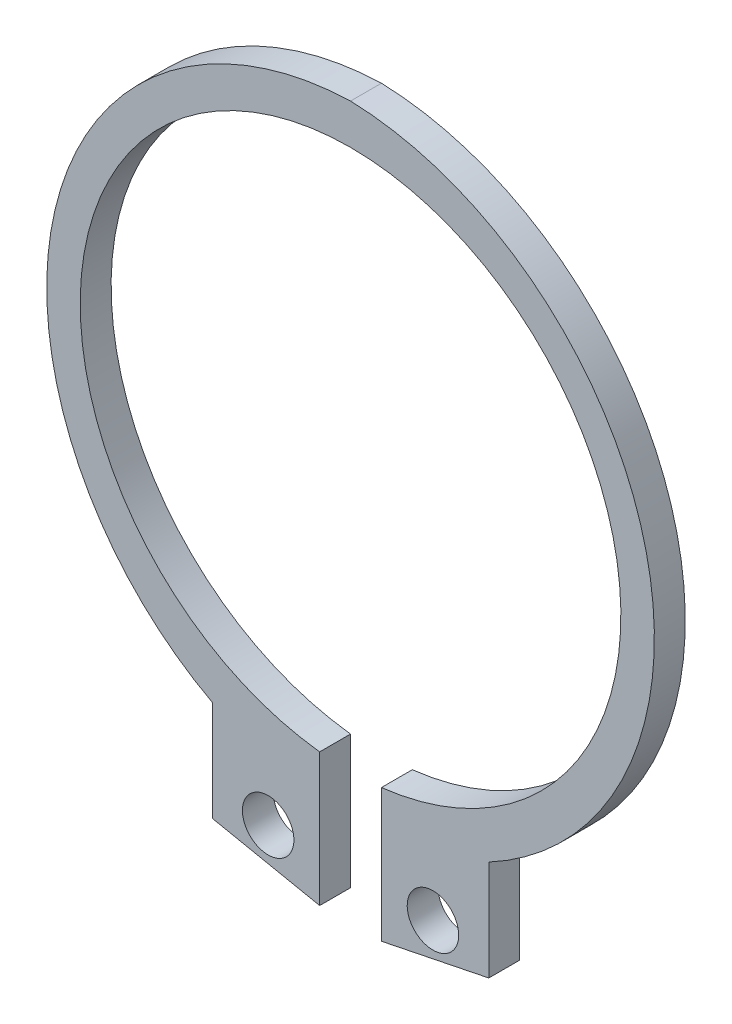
ISO-10303-21;
HEADER;
FILE_DESCRIPTION(('STEP AP214'),'2;1');
FILE_NAME('part.step','',(''),(''),'','','');
FILE_SCHEMA(('AUTOMOTIVE_DESIGN { 1 0 10303 214 1 1 1 1 }'));
ENDSEC;
DATA;
#1=APPLICATION_CONTEXT('core data for automotive mechanical design processes');
#2=APPLICATION_PROTOCOL_DEFINITION('international standard','automotive_design',2000,#1);
#3=PRODUCT_CONTEXT('',#1,'mechanical');
#4=PRODUCT('Part','Part','',(#3));
#5=PRODUCT_RELATED_PRODUCT_CATEGORY('part','',(#4));
#6=PRODUCT_DEFINITION_FORMATION('','',#4);
#7=PRODUCT_DEFINITION_CONTEXT('part definition',#1,'design');
#8=PRODUCT_DEFINITION('design','',#6,#7);
#9=PRODUCT_DEFINITION_SHAPE('','',#8);
#10=(LENGTH_UNIT() NAMED_UNIT(*) SI_UNIT(.MILLI.,.METRE.));
#11=(NAMED_UNIT(*) PLANE_ANGLE_UNIT() SI_UNIT($,.RADIAN.));
#12=(NAMED_UNIT(*) SI_UNIT($,.STERADIAN.) SOLID_ANGLE_UNIT());
#13=UNCERTAINTY_MEASURE_WITH_UNIT(LENGTH_MEASURE(1.E-05),#10,'distance_accuracy_value','');
#14=(GEOMETRIC_REPRESENTATION_CONTEXT(3) GLOBAL_UNCERTAINTY_ASSIGNED_CONTEXT((#13)) GLOBAL_UNIT_ASSIGNED_CONTEXT((#10,
#11,#12)) REPRESENTATION_CONTEXT('',''));
#15=CARTESIAN_POINT('',(0.,0.,0.));
#16=DIRECTION('',(0.,0.,1.));
#17=DIRECTION('',(1.,0.,0.));
#18=AXIS2_PLACEMENT_3D('',#15,#16,#17);
#19=CARTESIAN_POINT('',(-5.369716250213,-14.7531741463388,1.2));
#20=DIRECTION('',(0.199489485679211,0.979899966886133,0.));
#21=DIRECTION('',(-0.979899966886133,0.199489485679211,0.));
#22=AXIS2_PLACEMENT_3D('',#19,#20,#21);
#23=PLANE('',#22);
#24=DIRECTION('',(0.979899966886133,-0.199489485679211,0.));
#25=VECTOR('',#24,1.);
#26=CARTESIAN_POINT('',(-5.369716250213,-14.7531741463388,0.));
#27=LINE('',#26,#25);
#28=CARTESIAN_POINT('',(-5.369716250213,-14.7531741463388,0.));
#29=VERTEX_POINT('',#28);
#30=CARTESIAN_POINT('',(-1.2,-15.6020511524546,0.));
#31=VERTEX_POINT('',#30);
#32=EDGE_CURVE('E112',#29,#31,#27,.T.);
#33=ORIENTED_EDGE('',*,*,#32,.T.);
#34=DIRECTION('',(0.,0.,1.));
#35=VECTOR('',#34,1.);
#36=CARTESIAN_POINT('',(-1.2,-15.6020511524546,1.2));
#37=LINE('',#36,#35);
#38=CARTESIAN_POINT('',(-1.2,-15.6020511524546,1.2));
#39=VERTEX_POINT('',#38);
#40=EDGE_CURVE('E32',#31,#39,#37,.T.);
#41=ORIENTED_EDGE('',*,*,#40,.T.);
#42=DIRECTION('',(0.979899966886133,-0.199489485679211,0.));
#43=VECTOR('',#42,1.);
#44=CARTESIAN_POINT('',(-5.369716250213,-14.7531741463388,1.2));
#45=LINE('',#44,#43);
#46=CARTESIAN_POINT('',(-5.369716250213,-14.7531741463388,1.2));
#47=VERTEX_POINT('',#46);
#48=EDGE_CURVE('E138',#47,#39,#45,.T.);
#49=ORIENTED_EDGE('',*,*,#48,.F.);
#50=DIRECTION('',(0.,0.,-1.));
#51=VECTOR('',#50,1.);
#52=CARTESIAN_POINT('',(-5.369716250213,-14.7531741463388,1.2));
#53=LINE('',#52,#51);
#54=EDGE_CURVE('E131',#47,#29,#53,.T.);
#55=ORIENTED_EDGE('',*,*,#54,.T.);
#56=EDGE_LOOP('',(#33,#41,#49,#55));
#57=FACE_BOUND('',#56,.T.);
#58=ADVANCED_FACE('F17',(#57),#23,.F.);
#59=CARTESIAN_POINT('',(0.,0.,1.2));
#60=DIRECTION('',(0.,0.,-1.));
#61=DIRECTION('',(-1.,0.,0.));
#62=AXIS2_PLACEMENT_3D('',#59,#60,#61);
#63=CYLINDRICAL_SURFACE('',#62,10.5);
#64=DIRECTION('',(0.,0.,-1.));
#65=VECTOR('',#64,1.);
#66=CARTESIAN_POINT('',(-1.2,-10.4312031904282,1.2));
#67=LINE('',#66,#65);
#68=CARTESIAN_POINT('',(-1.2,-10.4312031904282,0.));
#69=VERTEX_POINT('',#68);
#70=CARTESIAN_POINT('',(-1.2,-10.4312031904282,1.2));
#71=VERTEX_POINT('',#70);
#72=EDGE_CURVE('E94',#69,#71,#67,.F.);
#73=ORIENTED_EDGE('',*,*,#72,.F.);
#74=CARTESIAN_POINT('',(0.,0.,0.));
#75=DIRECTION('',(0.,0.,1.));
#76=DIRECTION('',(1.,0.,0.));
#77=AXIS2_PLACEMENT_3D('',#74,#75,#76);
#78=CIRCLE('',#77,10.5);
#79=CARTESIAN_POINT('',(1.2,-10.4312031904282,0.));
#80=VERTEX_POINT('',#79);
#81=EDGE_CURVE('E101',#80,#69,#78,.T.);
#82=ORIENTED_EDGE('',*,*,#81,.F.);
#83=DIRECTION('',(0.,0.,-1.));
#84=VECTOR('',#83,1.);
#85=CARTESIAN_POINT('',(1.2,-10.4312031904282,1.2));
#86=LINE('',#85,#84);
#87=CARTESIAN_POINT('',(1.2,-10.4312031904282,1.2));
#88=VERTEX_POINT('',#87);
#89=EDGE_CURVE('E85',#88,#80,#86,.T.);
#90=ORIENTED_EDGE('',*,*,#89,.F.);
#91=CARTESIAN_POINT('',(0.,0.,1.2));
#92=DIRECTION('',(0.,0.,1.));
#93=DIRECTION('',(1.,0.,0.));
#94=AXIS2_PLACEMENT_3D('',#91,#92,#93);
#95=CIRCLE('',#94,10.5);
#96=EDGE_CURVE('E135',#88,#71,#95,.T.);
#97=ORIENTED_EDGE('',*,*,#96,.T.);
#98=EDGE_LOOP('',(#73,#82,#90,#97));
#99=FACE_BOUND('',#98,.T.);
#100=ADVANCED_FACE('F109',(#99),#63,.F.);
#101=CARTESIAN_POINT('',(0.380306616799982,-0.114910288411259,1.2));
#102=DIRECTION('',(0.,0.,-1.));
#103=DIRECTION('',(-1.,0.,0.));
#104=AXIS2_PLACEMENT_3D('',#101,#102,#103);
#105=CYLINDRICAL_SURFACE('',#104,12.1808486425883);
#106=CARTESIAN_POINT('',(0.380306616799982,-0.114910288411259,0.));
#107=DIRECTION('',(0.,0.,1.));
#108=DIRECTION('',(1.,0.,0.));
#109=AXIS2_PLACEMENT_3D('',#106,#107,#108);
#110=CIRCLE('',#109,12.1808486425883);
#111=CARTESIAN_POINT('',(0.,12.06,0.));
#112=VERTEX_POINT('',#111);
#113=CARTESIAN_POINT('',(-5.369716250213,-10.8531741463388,0.));
#114=VERTEX_POINT('',#113);
#115=EDGE_CURVE('E111',#112,#114,#110,.T.);
#116=ORIENTED_EDGE('',*,*,#115,.T.);
#117=DIRECTION('',(0.,0.,-1.));
#118=VECTOR('',#117,1.);
#119=CARTESIAN_POINT('',(-5.369716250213,-10.8531741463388,1.2));
#120=LINE('',#119,#118);
#121=CARTESIAN_POINT('',(-5.369716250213,-10.8531741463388,1.2));
#122=VERTEX_POINT('',#121);
#123=EDGE_CURVE('E145',#122,#114,#120,.T.);
#124=ORIENTED_EDGE('',*,*,#123,.F.);
#125=CARTESIAN_POINT('',(0.380306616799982,-0.114910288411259,1.2));
#126=DIRECTION('',(0.,0.,1.));
#127=DIRECTION('',(1.,0.,0.));
#128=AXIS2_PLACEMENT_3D('',#125,#126,#127);
#129=CIRCLE('',#128,12.1808486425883);
#130=CARTESIAN_POINT('',(0.,12.06,1.2));
#131=VERTEX_POINT('',#130);
#132=EDGE_CURVE('E132',#131,#122,#129,.T.);
#133=ORIENTED_EDGE('',*,*,#132,.F.);
#134=DIRECTION('',(0.,0.,-1.));
#135=VECTOR('',#134,1.);
#136=CARTESIAN_POINT('',(0.,12.06,1.2));
#137=LINE('',#136,#135);
#138=EDGE_CURVE('E25',#131,#112,#137,.T.);
#139=ORIENTED_EDGE('',*,*,#138,.T.);
#140=EDGE_LOOP('',(#116,#124,#133,#139));
#141=FACE_BOUND('',#140,.T.);
#142=ADVANCED_FACE('F238',(#141),#105,.T.);
#143=CARTESIAN_POINT('',(-5.369716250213,-14.7531741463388,1.2));
#144=DIRECTION('',(-1.,0.,0.));
#145=DIRECTION('',(0.,0.,1.));
#146=AXIS2_PLACEMENT_3D('',#143,#144,#145);
#147=PLANE('',#146);
#148=DIRECTION('',(0.,1.,0.));
#149=VECTOR('',#148,1.);
#150=CARTESIAN_POINT('',(-5.369716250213,-14.7531741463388,0.));
#151=LINE('',#150,#149);
#152=EDGE_CURVE('E119',#29,#114,#151,.T.);
#153=ORIENTED_EDGE('',*,*,#152,.F.);
#154=ORIENTED_EDGE('',*,*,#54,.F.);
#155=DIRECTION('',(0.,1.,0.));
#156=VECTOR('',#155,1.);
#157=CARTESIAN_POINT('',(-5.369716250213,-14.7531741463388,1.2));
#158=LINE('',#157,#156);
#159=EDGE_CURVE('E127',#47,#122,#158,.T.);
#160=ORIENTED_EDGE('',*,*,#159,.T.);
#161=ORIENTED_EDGE('',*,*,#123,.T.);
#162=EDGE_LOOP('',(#153,#154,#160,#161));
#163=FACE_BOUND('',#162,.T.);
#164=ADVANCED_FACE('F158',(#163),#147,.T.);
#165=CARTESIAN_POINT('',(0.,0.,1.2));
#166=DIRECTION('',(0.,0.,1.));
#167=DIRECTION('',(1.,0.,0.));
#168=AXIS2_PLACEMENT_3D('',#165,#166,#167);
#169=PLANE('',#168);
#170=CARTESIAN_POINT('',(3.2,-13.9,1.2));
#171=DIRECTION('',(0.,0.,-1.));
#172=DIRECTION('',(0.,1.,0.));
#173=AXIS2_PLACEMENT_3D('',#170,#171,#172);
#174=CIRCLE('',#173,1.);
#175=CARTESIAN_POINT('',(3.2,-12.9,1.2));
#176=VERTEX_POINT('',#175);
#177=EDGE_CURVE('E208',#176,#176,#174,.T.);
#178=ORIENTED_EDGE('',*,*,#177,.T.);
#179=EDGE_LOOP('',(#178));
#180=FACE_BOUND('',#179,.T.);
#181=CARTESIAN_POINT('',(-3.2,-13.9,1.2));
#182=DIRECTION('',(0.,0.,-1.));
#183=DIRECTION('',(0.,1.,0.));
#184=AXIS2_PLACEMENT_3D('',#181,#182,#183);
#185=CIRCLE('',#184,1.);
#186=CARTESIAN_POINT('',(-3.2,-12.9,1.2));
#187=VERTEX_POINT('',#186);
#188=EDGE_CURVE('E199',#187,#187,#185,.T.);
#189=ORIENTED_EDGE('',*,*,#188,.T.);
#190=EDGE_LOOP('',(#189));
#191=FACE_BOUND('',#190,.T.);
#192=DIRECTION('',(0.,1.,0.));
#193=VECTOR('',#192,1.);
#194=CARTESIAN_POINT('',(-1.2,-9.05,1.2));
#195=LINE('',#194,#193);
#196=EDGE_CURVE('E95',#39,#71,#195,.T.);
#197=ORIENTED_EDGE('',*,*,#196,.T.);
#198=ORIENTED_EDGE('',*,*,#96,.F.);
#199=DIRECTION('',(0.,-1.,0.));
#200=VECTOR('',#199,1.);
#201=CARTESIAN_POINT('',(1.2,-9.05,1.2));
#202=LINE('',#201,#200);
#203=CARTESIAN_POINT('',(1.2,-15.6020511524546,1.2));
#204=VERTEX_POINT('',#203);
#205=EDGE_CURVE('E88',#88,#204,#202,.T.);
#206=ORIENTED_EDGE('',*,*,#205,.T.);
#207=DIRECTION('',(-0.979899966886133,-0.199489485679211,0.));
#208=VECTOR('',#207,1.);
#209=CARTESIAN_POINT('',(5.369716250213,-14.7531741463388,1.2));
#210=LINE('',#209,#208);
#211=CARTESIAN_POINT('',(5.369716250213,-14.7531741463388,1.2));
#212=VERTEX_POINT('',#211);
#213=EDGE_CURVE('E179',#212,#204,#210,.T.);
#214=ORIENTED_EDGE('',*,*,#213,.F.);
#215=DIRECTION('',(0.,1.,0.));
#216=VECTOR('',#215,1.);
#217=CARTESIAN_POINT('',(5.369716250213,-14.7531741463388,1.2));
#218=LINE('',#217,#216);
#219=CARTESIAN_POINT('',(5.369716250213,-10.8531741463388,1.2));
#220=VERTEX_POINT('',#219);
#221=EDGE_CURVE('E173',#212,#220,#218,.T.);
#222=ORIENTED_EDGE('',*,*,#221,.T.);
#223=CARTESIAN_POINT('',(-0.380306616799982,-0.114910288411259,1.2));
#224=DIRECTION('',(0.,0.,-1.));
#225=DIRECTION('',(-1.,0.,0.));
#226=AXIS2_PLACEMENT_3D('',#223,#224,#225);
#227=CIRCLE('',#226,12.1808486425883);
#228=EDGE_CURVE('E183',#131,#220,#227,.T.);
#229=ORIENTED_EDGE('',*,*,#228,.F.);
#230=ORIENTED_EDGE('',*,*,#132,.T.);
#231=ORIENTED_EDGE('',*,*,#159,.F.);
#232=ORIENTED_EDGE('',*,*,#48,.T.);
#233=EDGE_LOOP('',(#197,#198,#206,#214,#222,#229,#230,#231,#232));
#234=FACE_BOUND('',#233,.T.);
#235=ADVANCED_FACE('F247',(#180,#191,#234),#169,.T.);
#236=CARTESIAN_POINT('',(0.,0.,0.));
#237=DIRECTION('',(0.,0.,1.));
#238=DIRECTION('',(1.,0.,0.));
#239=AXIS2_PLACEMENT_3D('',#236,#237,#238);
#240=PLANE('',#239);
#241=CARTESIAN_POINT('',(3.2,-13.9,0.));
#242=DIRECTION('',(0.,0.,1.));
#243=DIRECTION('',(0.,1.,0.));
#244=AXIS2_PLACEMENT_3D('',#241,#242,#243);
#245=CIRCLE('',#244,1.);
#246=CARTESIAN_POINT('',(3.2,-12.9,0.));
#247=VERTEX_POINT('',#246);
#248=EDGE_CURVE('E212',#247,#247,#245,.T.);
#249=ORIENTED_EDGE('',*,*,#248,.T.);
#250=EDGE_LOOP('',(#249));
#251=FACE_BOUND('',#250,.T.);
#252=CARTESIAN_POINT('',(-3.2,-13.9,0.));
#253=DIRECTION('',(0.,0.,1.));
#254=DIRECTION('',(0.,1.,0.));
#255=AXIS2_PLACEMENT_3D('',#252,#253,#254);
#256=CIRCLE('',#255,1.);
#257=CARTESIAN_POINT('',(-3.2,-12.9,0.));
#258=VERTEX_POINT('',#257);
#259=EDGE_CURVE('E204',#258,#258,#256,.T.);
#260=ORIENTED_EDGE('',*,*,#259,.T.);
#261=EDGE_LOOP('',(#260));
#262=FACE_BOUND('',#261,.T.);
#263=ORIENTED_EDGE('',*,*,#81,.T.);
#264=DIRECTION('',(0.,-1.,0.));
#265=VECTOR('',#264,1.);
#266=CARTESIAN_POINT('',(-1.2,-9.05,0.));
#267=LINE('',#266,#265);
#268=EDGE_CURVE('E106',#69,#31,#267,.T.);
#269=ORIENTED_EDGE('',*,*,#268,.T.);
#270=ORIENTED_EDGE('',*,*,#32,.F.);
#271=ORIENTED_EDGE('',*,*,#152,.T.);
#272=ORIENTED_EDGE('',*,*,#115,.F.);
#273=CARTESIAN_POINT('',(-0.380306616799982,-0.114910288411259,0.));
#274=DIRECTION('',(0.,0.,-1.));
#275=DIRECTION('',(-1.,0.,0.));
#276=AXIS2_PLACEMENT_3D('',#273,#274,#275);
#277=CIRCLE('',#276,12.1808486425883);
#278=CARTESIAN_POINT('',(5.369716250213,-10.8531741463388,0.));
#279=VERTEX_POINT('',#278);
#280=EDGE_CURVE('E172',#112,#279,#277,.T.);
#281=ORIENTED_EDGE('',*,*,#280,.T.);
#282=DIRECTION('',(0.,1.,0.));
#283=VECTOR('',#282,1.);
#284=CARTESIAN_POINT('',(5.369716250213,-14.7531741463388,0.));
#285=LINE('',#284,#283);
#286=CARTESIAN_POINT('',(5.369716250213,-14.7531741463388,0.));
#287=VERTEX_POINT('',#286);
#288=EDGE_CURVE('E167',#287,#279,#285,.T.);
#289=ORIENTED_EDGE('',*,*,#288,.F.);
#290=DIRECTION('',(-0.979899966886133,-0.199489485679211,0.));
#291=VECTOR('',#290,1.);
#292=CARTESIAN_POINT('',(5.369716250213,-14.7531741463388,0.));
#293=LINE('',#292,#291);
#294=CARTESIAN_POINT('',(1.2,-15.6020511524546,0.));
#295=VERTEX_POINT('',#294);
#296=EDGE_CURVE('E104',#287,#295,#293,.T.);
#297=ORIENTED_EDGE('',*,*,#296,.T.);
#298=DIRECTION('',(0.,1.,0.));
#299=VECTOR('',#298,1.);
#300=CARTESIAN_POINT('',(1.2,-9.05,0.));
#301=LINE('',#300,#299);
#302=EDGE_CURVE('E40',#295,#80,#301,.T.);
#303=ORIENTED_EDGE('',*,*,#302,.T.);
#304=EDGE_LOOP('',(#263,#269,#270,#271,#272,#281,#289,#297,#303));
#305=FACE_BOUND('',#304,.T.);
#306=ADVANCED_FACE('F100',(#251,#262,#305),#240,.F.);
#307=CARTESIAN_POINT('',(5.369716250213,-14.7531741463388,0.));
#308=DIRECTION('',(-0.199489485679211,0.979899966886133,0.));
#309=DIRECTION('',(0.979899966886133,0.199489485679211,0.));
#310=AXIS2_PLACEMENT_3D('',#307,#308,#309);
#311=PLANE('',#310);
#312=ORIENTED_EDGE('',*,*,#213,.T.);
#313=DIRECTION('',(0.,0.,-1.));
#314=VECTOR('',#313,1.);
#315=CARTESIAN_POINT('',(1.2,-15.6020511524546,0.));
#316=LINE('',#315,#314);
#317=EDGE_CURVE('E11',#204,#295,#316,.T.);
#318=ORIENTED_EDGE('',*,*,#317,.T.);
#319=ORIENTED_EDGE('',*,*,#296,.F.);
#320=DIRECTION('',(0.,0.,1.));
#321=VECTOR('',#320,1.);
#322=CARTESIAN_POINT('',(5.369716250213,-14.7531741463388,0.));
#323=LINE('',#322,#321);
#324=EDGE_CURVE('E164',#287,#212,#323,.T.);
#325=ORIENTED_EDGE('',*,*,#324,.T.);
#326=EDGE_LOOP('',(#312,#318,#319,#325));
#327=FACE_BOUND('',#326,.T.);
#328=ADVANCED_FACE('F253',(#327),#311,.F.);
#329=CARTESIAN_POINT('',(-0.380306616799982,-0.114910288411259,0.));
#330=DIRECTION('',(0.,0.,1.));
#331=DIRECTION('',(1.,0.,0.));
#332=AXIS2_PLACEMENT_3D('',#329,#330,#331);
#333=CYLINDRICAL_SURFACE('',#332,12.1808486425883);
#334=ORIENTED_EDGE('',*,*,#228,.T.);
#335=DIRECTION('',(0.,0.,1.));
#336=VECTOR('',#335,1.);
#337=CARTESIAN_POINT('',(5.369716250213,-10.8531741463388,0.));
#338=LINE('',#337,#336);
#339=EDGE_CURVE('E123',#279,#220,#338,.T.);
#340=ORIENTED_EDGE('',*,*,#339,.F.);
#341=ORIENTED_EDGE('',*,*,#280,.F.);
#342=ORIENTED_EDGE('',*,*,#138,.F.);
#343=EDGE_LOOP('',(#334,#340,#341,#342));
#344=FACE_BOUND('',#343,.T.);
#345=ADVANCED_FACE('F256',(#344),#333,.T.);
#346=CARTESIAN_POINT('',(5.369716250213,-14.7531741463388,0.));
#347=DIRECTION('',(1.,0.,0.));
#348=DIRECTION('',(0.,0.,-1.));
#349=AXIS2_PLACEMENT_3D('',#346,#347,#348);
#350=PLANE('',#349);
#351=ORIENTED_EDGE('',*,*,#221,.F.);
#352=ORIENTED_EDGE('',*,*,#324,.F.);
#353=ORIENTED_EDGE('',*,*,#288,.T.);
#354=ORIENTED_EDGE('',*,*,#339,.T.);
#355=EDGE_LOOP('',(#351,#352,#353,#354));
#356=FACE_BOUND('',#355,.T.);
#357=ADVANCED_FACE('F260',(#356),#350,.T.);
#358=CARTESIAN_POINT('',(1.2,-9.05,0.));
#359=DIRECTION('',(1.,0.,0.));
#360=DIRECTION('',(0.,0.,-1.));
#361=AXIS2_PLACEMENT_3D('',#358,#359,#360);
#362=PLANE('',#361);
#363=ORIENTED_EDGE('',*,*,#89,.T.);
#364=ORIENTED_EDGE('',*,*,#302,.F.);
#365=ORIENTED_EDGE('',*,*,#317,.F.);
#366=ORIENTED_EDGE('',*,*,#205,.F.);
#367=EDGE_LOOP('',(#363,#364,#365,#366));
#368=FACE_BOUND('',#367,.T.);
#369=ADVANCED_FACE('F86',(#368),#362,.F.);
#370=CARTESIAN_POINT('',(-1.2,-9.05,0.));
#371=DIRECTION('',(-1.,0.,0.));
#372=DIRECTION('',(0.,0.,1.));
#373=AXIS2_PLACEMENT_3D('',#370,#371,#372);
#374=PLANE('',#373);
#375=ORIENTED_EDGE('',*,*,#268,.F.);
#376=ORIENTED_EDGE('',*,*,#72,.T.);
#377=ORIENTED_EDGE('',*,*,#196,.F.);
#378=ORIENTED_EDGE('',*,*,#40,.F.);
#379=EDGE_LOOP('',(#375,#376,#377,#378));
#380=FACE_BOUND('',#379,.T.);
#381=ADVANCED_FACE('F230',(#380),#374,.F.);
#382=CARTESIAN_POINT('',(-3.2,-13.9,0.));
#383=DIRECTION('',(0.,0.,1.));
#384=DIRECTION('',(0.,1.,0.));
#385=AXIS2_PLACEMENT_3D('',#382,#383,#384);
#386=CYLINDRICAL_SURFACE('',#385,1.);
#387=ORIENTED_EDGE('',*,*,#188,.F.);
#388=EDGE_LOOP('',(#387));
#389=FACE_BOUND('',#388,.T.);
#390=ORIENTED_EDGE('',*,*,#259,.F.);
#391=EDGE_LOOP('',(#390));
#392=FACE_BOUND('',#391,.T.);
#393=ADVANCED_FACE('F223',(#389,#392),#386,.F.);
#394=CARTESIAN_POINT('',(3.2,-13.9,0.));
#395=DIRECTION('',(0.,0.,1.));
#396=DIRECTION('',(0.,1.,0.));
#397=AXIS2_PLACEMENT_3D('',#394,#395,#396);
#398=CYLINDRICAL_SURFACE('',#397,1.);
#399=ORIENTED_EDGE('',*,*,#177,.F.);
#400=EDGE_LOOP('',(#399));
#401=FACE_BOUND('',#400,.T.);
#402=ORIENTED_EDGE('',*,*,#248,.F.);
#403=EDGE_LOOP('',(#402));
#404=FACE_BOUND('',#403,.T.);
#405=ADVANCED_FACE('F221',(#401,#404),#398,.F.);
#406=CLOSED_SHELL('',(#58,#100,#142,#164,#235,#306,#328,#345,#357,#369,#381,#393,#405));
#407=MANIFOLD_SOLID_BREP('B1',#406);
#408=ADVANCED_BREP_SHAPE_REPRESENTATION('',(#18,#407),#14);
#409=SHAPE_DEFINITION_REPRESENTATION(#9,#408);
ENDSEC;
END-ISO-10303-21;
